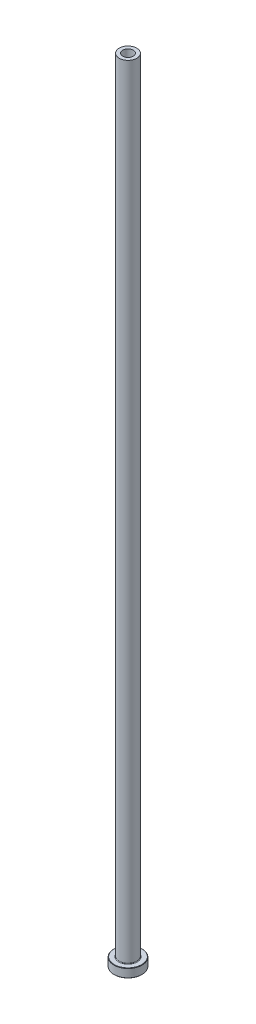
from build123d import *

# Parameters (mm, degrees)
FILLET1_R     = 0.3
CHAMFER1_SIZE = 0.2
CHAMFER3_SIZE = 0.5


with BuildPart() as part:
    # Sketch1 → Revolve1 (revolve)
    with BuildSketch(Plane.XY, mode=Mode.PRIVATE) as revolve1_sk:
        Polygon((-3, 450), (-5, 450), (-5, 5), (-8, 5), (-8, 0), (-3.25, 0), (-3.25, 393), (-3, 405), align=None)
    revolve(revolve1_sk.sketch.rotate(Axis((0, 92.187680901, 0), (0, -1, 0)), 270), axis=Axis((0, 92.187680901, 0), (0, -1, 0)))

    # Fillet1
    fillet1_edges = [part.edges().sort_by_distance(p)[0] for p in [
        (0, 5, -5),
    ]]
    fillet(fillet1_edges, radius=FILLET1_R)

    # Chamfer1
    chamfer1_edges = [part.edges().sort_by_distance(p)[0] for p in [
        (0, 0, -8),
        (0, 5, -8),
    ]]
    chamfer(chamfer1_edges, length=CHAMFER1_SIZE)

    # Chamfer3
    chamfer3_edges = [part.edges().sort_by_distance(p)[0] for p in [
        (0, 0, -3.25),
    ]]
    chamfer(chamfer3_edges, length=CHAMFER3_SIZE)


solid = part.part
